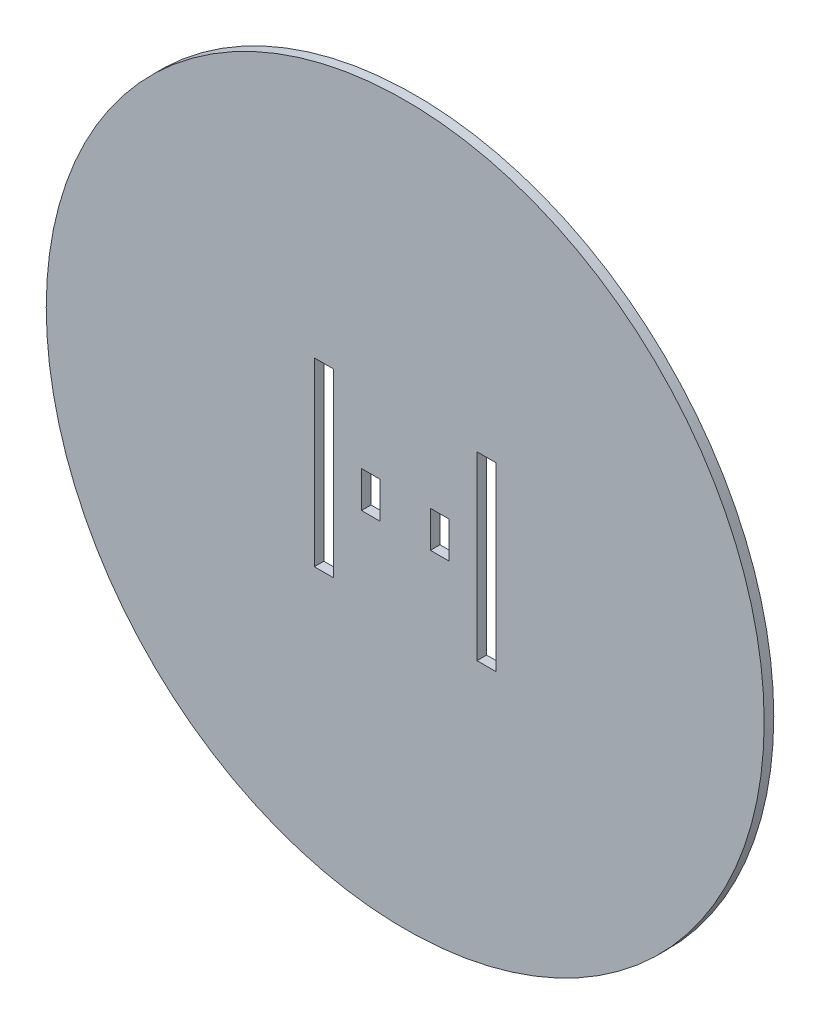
ISO-10303-21;
HEADER;
FILE_DESCRIPTION(('STEP AP214'),'2;1');
FILE_NAME('part.step','',(''),(''),'','','');
FILE_SCHEMA(('AUTOMOTIVE_DESIGN { 1 0 10303 214 1 1 1 1 }'));
ENDSEC;
DATA;
#1=APPLICATION_CONTEXT('core data for automotive mechanical design processes');
#2=APPLICATION_PROTOCOL_DEFINITION('international standard','automotive_design',2000,#1);
#3=PRODUCT_CONTEXT('',#1,'mechanical');
#4=PRODUCT('Part','Part','',(#3));
#5=PRODUCT_RELATED_PRODUCT_CATEGORY('part','',(#4));
#6=PRODUCT_DEFINITION_FORMATION('','',#4);
#7=PRODUCT_DEFINITION_CONTEXT('part definition',#1,'design');
#8=PRODUCT_DEFINITION('design','',#6,#7);
#9=PRODUCT_DEFINITION_SHAPE('','',#8);
#10=(LENGTH_UNIT() NAMED_UNIT(*) SI_UNIT(.MILLI.,.METRE.));
#11=(NAMED_UNIT(*) PLANE_ANGLE_UNIT() SI_UNIT($,.RADIAN.));
#12=(NAMED_UNIT(*) SI_UNIT($,.STERADIAN.) SOLID_ANGLE_UNIT());
#13=UNCERTAINTY_MEASURE_WITH_UNIT(LENGTH_MEASURE(1.E-05),#10,'distance_accuracy_value','');
#14=(GEOMETRIC_REPRESENTATION_CONTEXT(3) GLOBAL_UNCERTAINTY_ASSIGNED_CONTEXT((#13)) GLOBAL_UNIT_ASSIGNED_CONTEXT((#10,
#11,#12)) REPRESENTATION_CONTEXT('',''));
#15=CARTESIAN_POINT('',(0.,0.,0.));
#16=DIRECTION('',(0.,0.,1.));
#17=DIRECTION('',(1.,0.,0.));
#18=AXIS2_PLACEMENT_3D('',#15,#16,#17);
#19=CARTESIAN_POINT('',(0.,0.,3.));
#20=DIRECTION('',(0.,0.,1.));
#21=DIRECTION('',(1.,0.,0.));
#22=AXIS2_PLACEMENT_3D('',#19,#20,#21);
#23=PLANE('',#22);
#24=CARTESIAN_POINT('',(0.,0.,3.));
#25=DIRECTION('',(0.,0.,1.));
#26=DIRECTION('',(1.,0.,0.));
#27=AXIS2_PLACEMENT_3D('',#24,#25,#26);
#28=CIRCLE('',#27,112.5);
#29=CARTESIAN_POINT('',(112.5,0.,3.));
#30=VERTEX_POINT('',#29);
#31=EDGE_CURVE('E11',#30,#30,#28,.T.);
#32=ORIENTED_EDGE('',*,*,#31,.T.);
#33=EDGE_LOOP('',(#32));
#34=FACE_BOUND('',#33,.T.);
#35=DIRECTION('',(1.,0.,0.));
#36=VECTOR('',#35,1.);
#37=CARTESIAN_POINT('',(-13.6999999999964,-5.7,3.));
#38=LINE('',#37,#36);
#39=CARTESIAN_POINT('',(-13.6999999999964,-5.7,3.));
#40=VERTEX_POINT('',#39);
#41=CARTESIAN_POINT('',(-7.89999999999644,-5.7,3.));
#42=VERTEX_POINT('',#41);
#43=EDGE_CURVE('E245',#40,#42,#38,.T.);
#44=ORIENTED_EDGE('',*,*,#43,.F.);
#45=DIRECTION('',(0.,-1.,0.));
#46=VECTOR('',#45,1.);
#47=CARTESIAN_POINT('',(-13.6999999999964,-5.7,3.));
#48=LINE('',#47,#46);
#49=CARTESIAN_POINT('',(-13.6999999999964,5.7,3.));
#50=VERTEX_POINT('',#49);
#51=EDGE_CURVE('E243',#50,#40,#48,.T.);
#52=ORIENTED_EDGE('',*,*,#51,.F.);
#53=DIRECTION('',(-1.,0.,0.));
#54=VECTOR('',#53,1.);
#55=CARTESIAN_POINT('',(-13.6999999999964,5.7,3.));
#56=LINE('',#55,#54);
#57=CARTESIAN_POINT('',(-7.89999999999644,5.7,3.));
#58=VERTEX_POINT('',#57);
#59=EDGE_CURVE('E251',#58,#50,#56,.T.);
#60=ORIENTED_EDGE('',*,*,#59,.F.);
#61=DIRECTION('',(0.,1.,0.));
#62=VECTOR('',#61,1.);
#63=CARTESIAN_POINT('',(-7.89999999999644,-5.7,3.));
#64=LINE('',#63,#62);
#65=EDGE_CURVE('E248',#42,#58,#64,.T.);
#66=ORIENTED_EDGE('',*,*,#65,.F.);
#67=EDGE_LOOP('',(#44,#52,#60,#66));
#68=FACE_BOUND('',#67,.T.);
#69=DIRECTION('',(-1.,0.,0.));
#70=VECTOR('',#69,1.);
#71=CARTESIAN_POINT('',(13.7000000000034,5.7,3.));
#72=LINE('',#71,#70);
#73=CARTESIAN_POINT('',(13.7000000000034,5.7,3.));
#74=VERTEX_POINT('',#73);
#75=CARTESIAN_POINT('',(7.90000000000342,5.7,3.));
#76=VERTEX_POINT('',#75);
#77=EDGE_CURVE('E214',#74,#76,#72,.T.);
#78=ORIENTED_EDGE('',*,*,#77,.F.);
#79=DIRECTION('',(0.,1.,0.));
#80=VECTOR('',#79,1.);
#81=CARTESIAN_POINT('',(13.7000000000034,-5.7,3.));
#82=LINE('',#81,#80);
#83=CARTESIAN_POINT('',(13.7000000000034,-5.7,3.));
#84=VERTEX_POINT('',#83);
#85=EDGE_CURVE('E212',#84,#74,#82,.T.);
#86=ORIENTED_EDGE('',*,*,#85,.F.);
#87=DIRECTION('',(1.,0.,0.));
#88=VECTOR('',#87,1.);
#89=CARTESIAN_POINT('',(13.7000000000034,-5.7,3.));
#90=LINE('',#89,#88);
#91=CARTESIAN_POINT('',(7.90000000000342,-5.7,3.));
#92=VERTEX_POINT('',#91);
#93=EDGE_CURVE('E220',#92,#84,#90,.T.);
#94=ORIENTED_EDGE('',*,*,#93,.F.);
#95=DIRECTION('',(0.,-1.,0.));
#96=VECTOR('',#95,1.);
#97=CARTESIAN_POINT('',(7.90000000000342,-5.7,3.));
#98=LINE('',#97,#96);
#99=EDGE_CURVE('E217',#76,#92,#98,.T.);
#100=ORIENTED_EDGE('',*,*,#99,.F.);
#101=EDGE_LOOP('',(#78,#86,#94,#100));
#102=FACE_BOUND('',#101,.T.);
#103=DIRECTION('',(-1.,0.,0.));
#104=VECTOR('',#103,1.);
#105=CARTESIAN_POINT('',(-28.4799999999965,28.3399999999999,3.));
#106=LINE('',#105,#104);
#107=CARTESIAN_POINT('',(-22.4999999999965,28.3399999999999,3.));
#108=VERTEX_POINT('',#107);
#109=CARTESIAN_POINT('',(-28.4799999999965,28.3399999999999,3.));
#110=VERTEX_POINT('',#109);
#111=EDGE_CURVE('E183',#108,#110,#106,.T.);
#112=ORIENTED_EDGE('',*,*,#111,.F.);
#113=DIRECTION('',(0.,1.,0.));
#114=VECTOR('',#113,1.);
#115=CARTESIAN_POINT('',(-22.4999999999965,28.3399999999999,3.));
#116=LINE('',#115,#114);
#117=CARTESIAN_POINT('',(-22.4999999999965,-28.3400000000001,3.));
#118=VERTEX_POINT('',#117);
#119=EDGE_CURVE('E181',#118,#108,#116,.T.);
#120=ORIENTED_EDGE('',*,*,#119,.F.);
#121=DIRECTION('',(1.,0.,0.));
#122=VECTOR('',#121,1.);
#123=CARTESIAN_POINT('',(-28.4799999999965,-28.3400000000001,3.));
#124=LINE('',#123,#122);
#125=CARTESIAN_POINT('',(-28.4799999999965,-28.3400000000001,3.));
#126=VERTEX_POINT('',#125);
#127=EDGE_CURVE('E189',#126,#118,#124,.T.);
#128=ORIENTED_EDGE('',*,*,#127,.F.);
#129=DIRECTION('',(0.,-1.,0.));
#130=VECTOR('',#129,1.);
#131=CARTESIAN_POINT('',(-28.4799999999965,28.3399999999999,3.));
#132=LINE('',#131,#130);
#133=EDGE_CURVE('E186',#110,#126,#132,.T.);
#134=ORIENTED_EDGE('',*,*,#133,.F.);
#135=EDGE_LOOP('',(#112,#120,#128,#134));
#136=FACE_BOUND('',#135,.T.);
#137=DIRECTION('',(-1.,0.,0.));
#138=VECTOR('',#137,1.);
#139=CARTESIAN_POINT('',(28.4800000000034,28.3399999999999,3.));
#140=LINE('',#139,#138);
#141=CARTESIAN_POINT('',(28.4800000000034,28.3399999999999,3.));
#142=VERTEX_POINT('',#141);
#143=CARTESIAN_POINT('',(22.5000000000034,28.3399999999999,3.));
#144=VERTEX_POINT('',#143);
#145=EDGE_CURVE('E153',#142,#144,#140,.T.);
#146=ORIENTED_EDGE('',*,*,#145,.F.);
#147=DIRECTION('',(0.,1.,0.));
#148=VECTOR('',#147,1.);
#149=CARTESIAN_POINT('',(28.4800000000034,28.3399999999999,3.));
#150=LINE('',#149,#148);
#151=CARTESIAN_POINT('',(28.4800000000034,-28.3400000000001,3.));
#152=VERTEX_POINT('',#151);
#153=EDGE_CURVE('E145',#152,#142,#150,.T.);
#154=ORIENTED_EDGE('',*,*,#153,.F.);
#155=DIRECTION('',(1.,0.,0.));
#156=VECTOR('',#155,1.);
#157=CARTESIAN_POINT('',(28.4800000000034,-28.3400000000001,3.));
#158=LINE('',#157,#156);
#159=CARTESIAN_POINT('',(22.5000000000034,-28.3400000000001,3.));
#160=VERTEX_POINT('',#159);
#161=EDGE_CURVE('E167',#160,#152,#158,.T.);
#162=ORIENTED_EDGE('',*,*,#161,.F.);
#163=DIRECTION('',(0.,-1.,0.));
#164=VECTOR('',#163,1.);
#165=CARTESIAN_POINT('',(22.5000000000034,28.3399999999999,3.));
#166=LINE('',#165,#164);
#167=EDGE_CURVE('E165',#144,#160,#166,.T.);
#168=ORIENTED_EDGE('',*,*,#167,.F.);
#169=EDGE_LOOP('',(#146,#154,#162,#168));
#170=FACE_BOUND('',#169,.T.);
#171=ADVANCED_FACE('F32',(#34,#68,#102,#136,#170),#23,.T.);
#172=CARTESIAN_POINT('',(0.,0.,0.));
#173=DIRECTION('',(0.,0.,1.));
#174=DIRECTION('',(1.,0.,0.));
#175=AXIS2_PLACEMENT_3D('',#172,#173,#174);
#176=PLANE('',#175);
#177=DIRECTION('',(0.,1.,0.));
#178=VECTOR('',#177,1.);
#179=CARTESIAN_POINT('',(-22.4999999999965,28.3399999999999,0.));
#180=LINE('',#179,#178);
#181=CARTESIAN_POINT('',(-22.4999999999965,-28.3400000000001,0.));
#182=VERTEX_POINT('',#181);
#183=CARTESIAN_POINT('',(-22.4999999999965,28.3399999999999,0.));
#184=VERTEX_POINT('',#183);
#185=EDGE_CURVE('E161',#182,#184,#180,.T.);
#186=ORIENTED_EDGE('',*,*,#185,.T.);
#187=DIRECTION('',(-1.,0.,0.));
#188=VECTOR('',#187,1.);
#189=CARTESIAN_POINT('',(-28.4799999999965,28.3399999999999,0.));
#190=LINE('',#189,#188);
#191=CARTESIAN_POINT('',(-28.4799999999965,28.3399999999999,0.));
#192=VERTEX_POINT('',#191);
#193=EDGE_CURVE('E194',#184,#192,#190,.T.);
#194=ORIENTED_EDGE('',*,*,#193,.T.);
#195=DIRECTION('',(0.,-1.,0.));
#196=VECTOR('',#195,1.);
#197=CARTESIAN_POINT('',(-28.4799999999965,28.3399999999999,0.));
#198=LINE('',#197,#196);
#199=CARTESIAN_POINT('',(-28.4799999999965,-28.3400000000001,0.));
#200=VERTEX_POINT('',#199);
#201=EDGE_CURVE('E197',#192,#200,#198,.T.);
#202=ORIENTED_EDGE('',*,*,#201,.T.);
#203=DIRECTION('',(1.,0.,0.));
#204=VECTOR('',#203,1.);
#205=CARTESIAN_POINT('',(-28.4799999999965,-28.3400000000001,0.));
#206=LINE('',#205,#204);
#207=EDGE_CURVE('E184',#200,#182,#206,.T.);
#208=ORIENTED_EDGE('',*,*,#207,.T.);
#209=EDGE_LOOP('',(#186,#194,#202,#208));
#210=FACE_BOUND('',#209,.T.);
#211=DIRECTION('',(0.,-1.,0.));
#212=VECTOR('',#211,1.);
#213=CARTESIAN_POINT('',(-13.6999999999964,-5.7,0.));
#214=LINE('',#213,#212);
#215=CARTESIAN_POINT('',(-13.6999999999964,5.7,0.));
#216=VERTEX_POINT('',#215);
#217=CARTESIAN_POINT('',(-13.6999999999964,-5.7,0.));
#218=VERTEX_POINT('',#217);
#219=EDGE_CURVE('E242',#216,#218,#214,.T.);
#220=ORIENTED_EDGE('',*,*,#219,.T.);
#221=DIRECTION('',(1.,0.,0.));
#222=VECTOR('',#221,1.);
#223=CARTESIAN_POINT('',(-13.6999999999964,-5.7,0.));
#224=LINE('',#223,#222);
#225=CARTESIAN_POINT('',(-7.89999999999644,-5.7,0.));
#226=VERTEX_POINT('',#225);
#227=EDGE_CURVE('E256',#218,#226,#224,.T.);
#228=ORIENTED_EDGE('',*,*,#227,.T.);
#229=DIRECTION('',(0.,1.,0.));
#230=VECTOR('',#229,1.);
#231=CARTESIAN_POINT('',(-7.89999999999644,-5.7,0.));
#232=LINE('',#231,#230);
#233=CARTESIAN_POINT('',(-7.89999999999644,5.7,0.));
#234=VERTEX_POINT('',#233);
#235=EDGE_CURVE('E259',#226,#234,#232,.T.);
#236=ORIENTED_EDGE('',*,*,#235,.T.);
#237=DIRECTION('',(-1.,0.,0.));
#238=VECTOR('',#237,1.);
#239=CARTESIAN_POINT('',(-13.6999999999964,5.7,0.));
#240=LINE('',#239,#238);
#241=EDGE_CURVE('E246',#234,#216,#240,.T.);
#242=ORIENTED_EDGE('',*,*,#241,.T.);
#243=EDGE_LOOP('',(#220,#228,#236,#242));
#244=FACE_BOUND('',#243,.T.);
#245=CARTESIAN_POINT('',(0.,0.,0.));
#246=DIRECTION('',(0.,0.,1.));
#247=DIRECTION('',(1.,0.,0.));
#248=AXIS2_PLACEMENT_3D('',#245,#246,#247);
#249=CIRCLE('',#248,112.5);
#250=CARTESIAN_POINT('',(112.5,0.,0.));
#251=VERTEX_POINT('',#250);
#252=EDGE_CURVE('E36',#251,#251,#249,.T.);
#253=ORIENTED_EDGE('',*,*,#252,.F.);
#254=EDGE_LOOP('',(#253));
#255=FACE_BOUND('',#254,.T.);
#256=DIRECTION('',(0.,1.,0.));
#257=VECTOR('',#256,1.);
#258=CARTESIAN_POINT('',(13.7000000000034,-5.7,0.));
#259=LINE('',#258,#257);
#260=CARTESIAN_POINT('',(13.7000000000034,-5.7,0.));
#261=VERTEX_POINT('',#260);
#262=CARTESIAN_POINT('',(13.7000000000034,5.7,0.));
#263=VERTEX_POINT('',#262);
#264=EDGE_CURVE('E211',#261,#263,#259,.T.);
#265=ORIENTED_EDGE('',*,*,#264,.T.);
#266=DIRECTION('',(-1.,0.,0.));
#267=VECTOR('',#266,1.);
#268=CARTESIAN_POINT('',(13.7000000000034,5.7,0.));
#269=LINE('',#268,#267);
#270=CARTESIAN_POINT('',(7.90000000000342,5.7,0.));
#271=VERTEX_POINT('',#270);
#272=EDGE_CURVE('E225',#263,#271,#269,.T.);
#273=ORIENTED_EDGE('',*,*,#272,.T.);
#274=DIRECTION('',(0.,-1.,0.));
#275=VECTOR('',#274,1.);
#276=CARTESIAN_POINT('',(7.90000000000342,-5.7,0.));
#277=LINE('',#276,#275);
#278=CARTESIAN_POINT('',(7.90000000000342,-5.7,0.));
#279=VERTEX_POINT('',#278);
#280=EDGE_CURVE('E228',#271,#279,#277,.T.);
#281=ORIENTED_EDGE('',*,*,#280,.T.);
#282=DIRECTION('',(1.,0.,0.));
#283=VECTOR('',#282,1.);
#284=CARTESIAN_POINT('',(13.7000000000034,-5.7,0.));
#285=LINE('',#284,#283);
#286=EDGE_CURVE('E215',#279,#261,#285,.T.);
#287=ORIENTED_EDGE('',*,*,#286,.T.);
#288=EDGE_LOOP('',(#265,#273,#281,#287));
#289=FACE_BOUND('',#288,.T.);
#290=DIRECTION('',(0.,1.,0.));
#291=VECTOR('',#290,1.);
#292=CARTESIAN_POINT('',(28.4800000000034,28.3399999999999,0.));
#293=LINE('',#292,#291);
#294=CARTESIAN_POINT('',(28.4800000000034,-28.3400000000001,0.));
#295=VERTEX_POINT('',#294);
#296=CARTESIAN_POINT('',(28.4800000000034,28.3399999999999,0.));
#297=VERTEX_POINT('',#296);
#298=EDGE_CURVE('E55',#295,#297,#293,.T.);
#299=ORIENTED_EDGE('',*,*,#298,.T.);
#300=DIRECTION('',(-1.,0.,0.));
#301=VECTOR('',#300,1.);
#302=CARTESIAN_POINT('',(28.4800000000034,28.3399999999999,0.));
#303=LINE('',#302,#301);
#304=CARTESIAN_POINT('',(22.5000000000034,28.3399999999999,0.));
#305=VERTEX_POINT('',#304);
#306=EDGE_CURVE('E160',#297,#305,#303,.T.);
#307=ORIENTED_EDGE('',*,*,#306,.T.);
#308=DIRECTION('',(0.,-1.,0.));
#309=VECTOR('',#308,1.);
#310=CARTESIAN_POINT('',(22.5000000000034,28.3399999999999,0.));
#311=LINE('',#310,#309);
#312=CARTESIAN_POINT('',(22.5000000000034,-28.3400000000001,0.));
#313=VERTEX_POINT('',#312);
#314=EDGE_CURVE('E173',#305,#313,#311,.T.);
#315=ORIENTED_EDGE('',*,*,#314,.T.);
#316=DIRECTION('',(1.,0.,0.));
#317=VECTOR('',#316,1.);
#318=CARTESIAN_POINT('',(28.4800000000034,-28.3400000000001,0.));
#319=LINE('',#318,#317);
#320=EDGE_CURVE('E154',#313,#295,#319,.T.);
#321=ORIENTED_EDGE('',*,*,#320,.T.);
#322=EDGE_LOOP('',(#299,#307,#315,#321));
#323=FACE_BOUND('',#322,.T.);
#324=ADVANCED_FACE('F278',(#210,#244,#255,#289,#323),#176,.F.);
#325=CARTESIAN_POINT('',(0.,0.,3.));
#326=DIRECTION('',(0.,0.,-1.));
#327=DIRECTION('',(-1.,0.,0.));
#328=AXIS2_PLACEMENT_3D('',#325,#326,#327);
#329=CYLINDRICAL_SURFACE('',#328,112.5);
#330=ORIENTED_EDGE('',*,*,#31,.F.);
#331=EDGE_LOOP('',(#330));
#332=FACE_BOUND('',#331,.T.);
#333=ORIENTED_EDGE('',*,*,#252,.T.);
#334=EDGE_LOOP('',(#333));
#335=FACE_BOUND('',#334,.T.);
#336=ADVANCED_FACE('F34',(#332,#335),#329,.T.);
#337=CARTESIAN_POINT('',(-13.6999999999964,-5.7,3.));
#338=DIRECTION('',(1.,0.,0.));
#339=DIRECTION('',(0.,0.,-1.));
#340=AXIS2_PLACEMENT_3D('',#337,#338,#339);
#341=PLANE('',#340);
#342=ORIENTED_EDGE('',*,*,#219,.F.);
#343=DIRECTION('',(0.,0.,-1.));
#344=VECTOR('',#343,1.);
#345=CARTESIAN_POINT('',(-13.6999999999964,5.7,3.));
#346=LINE('',#345,#344);
#347=EDGE_CURVE('E253',#50,#216,#346,.T.);
#348=ORIENTED_EDGE('',*,*,#347,.F.);
#349=ORIENTED_EDGE('',*,*,#51,.T.);
#350=DIRECTION('',(0.,0.,-1.));
#351=VECTOR('',#350,1.);
#352=CARTESIAN_POINT('',(-13.6999999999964,-5.7,3.));
#353=LINE('',#352,#351);
#354=EDGE_CURVE('E270',#40,#218,#353,.T.);
#355=ORIENTED_EDGE('',*,*,#354,.T.);
#356=EDGE_LOOP('',(#342,#348,#349,#355));
#357=FACE_BOUND('',#356,.T.);
#358=ADVANCED_FACE('F300',(#357),#341,.T.);
#359=CARTESIAN_POINT('',(-13.6999999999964,-5.7,3.));
#360=DIRECTION('',(0.,1.,0.));
#361=DIRECTION('',(0.,0.,1.));
#362=AXIS2_PLACEMENT_3D('',#359,#360,#361);
#363=PLANE('',#362);
#364=ORIENTED_EDGE('',*,*,#227,.F.);
#365=ORIENTED_EDGE('',*,*,#354,.F.);
#366=ORIENTED_EDGE('',*,*,#43,.T.);
#367=DIRECTION('',(0.,0.,-1.));
#368=VECTOR('',#367,1.);
#369=CARTESIAN_POINT('',(-7.89999999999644,-5.7,3.));
#370=LINE('',#369,#368);
#371=EDGE_CURVE('E268',#42,#226,#370,.T.);
#372=ORIENTED_EDGE('',*,*,#371,.T.);
#373=EDGE_LOOP('',(#364,#365,#366,#372));
#374=FACE_BOUND('',#373,.T.);
#375=ADVANCED_FACE('F303',(#374),#363,.T.);
#376=CARTESIAN_POINT('',(-7.89999999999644,-5.7,3.));
#377=DIRECTION('',(-1.,0.,0.));
#378=DIRECTION('',(0.,0.,1.));
#379=AXIS2_PLACEMENT_3D('',#376,#377,#378);
#380=PLANE('',#379);
#381=ORIENTED_EDGE('',*,*,#235,.F.);
#382=ORIENTED_EDGE('',*,*,#371,.F.);
#383=ORIENTED_EDGE('',*,*,#65,.T.);
#384=DIRECTION('',(0.,0.,-1.));
#385=VECTOR('',#384,1.);
#386=CARTESIAN_POINT('',(-7.89999999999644,5.7,3.));
#387=LINE('',#386,#385);
#388=EDGE_CURVE('E266',#58,#234,#387,.T.);
#389=ORIENTED_EDGE('',*,*,#388,.T.);
#390=EDGE_LOOP('',(#381,#382,#383,#389));
#391=FACE_BOUND('',#390,.T.);
#392=ADVANCED_FACE('F306',(#391),#380,.T.);
#393=CARTESIAN_POINT('',(-13.6999999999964,5.7,3.));
#394=DIRECTION('',(0.,-1.,0.));
#395=DIRECTION('',(0.,0.,-1.));
#396=AXIS2_PLACEMENT_3D('',#393,#394,#395);
#397=PLANE('',#396);
#398=ORIENTED_EDGE('',*,*,#241,.F.);
#399=ORIENTED_EDGE('',*,*,#388,.F.);
#400=ORIENTED_EDGE('',*,*,#59,.T.);
#401=ORIENTED_EDGE('',*,*,#347,.T.);
#402=EDGE_LOOP('',(#398,#399,#400,#401));
#403=FACE_BOUND('',#402,.T.);
#404=ADVANCED_FACE('F310',(#403),#397,.T.);
#405=CARTESIAN_POINT('',(13.7000000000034,-5.7,3.));
#406=DIRECTION('',(-1.,0.,0.));
#407=DIRECTION('',(0.,0.,1.));
#408=AXIS2_PLACEMENT_3D('',#405,#406,#407);
#409=PLANE('',#408);
#410=ORIENTED_EDGE('',*,*,#264,.F.);
#411=DIRECTION('',(0.,0.,-1.));
#412=VECTOR('',#411,1.);
#413=CARTESIAN_POINT('',(13.7000000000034,-5.7,3.));
#414=LINE('',#413,#412);
#415=EDGE_CURVE('E222',#84,#261,#414,.T.);
#416=ORIENTED_EDGE('',*,*,#415,.F.);
#417=ORIENTED_EDGE('',*,*,#85,.T.);
#418=DIRECTION('',(0.,0.,-1.));
#419=VECTOR('',#418,1.);
#420=CARTESIAN_POINT('',(13.7000000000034,5.7,3.));
#421=LINE('',#420,#419);
#422=EDGE_CURVE('E239',#74,#263,#421,.T.);
#423=ORIENTED_EDGE('',*,*,#422,.T.);
#424=EDGE_LOOP('',(#410,#416,#417,#423));
#425=FACE_BOUND('',#424,.T.);
#426=ADVANCED_FACE('F314',(#425),#409,.T.);
#427=CARTESIAN_POINT('',(13.7000000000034,5.7,3.));
#428=DIRECTION('',(0.,-1.,0.));
#429=DIRECTION('',(0.,0.,-1.));
#430=AXIS2_PLACEMENT_3D('',#427,#428,#429);
#431=PLANE('',#430);
#432=ORIENTED_EDGE('',*,*,#272,.F.);
#433=ORIENTED_EDGE('',*,*,#422,.F.);
#434=ORIENTED_EDGE('',*,*,#77,.T.);
#435=DIRECTION('',(0.,0.,-1.));
#436=VECTOR('',#435,1.);
#437=CARTESIAN_POINT('',(7.90000000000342,5.7,3.));
#438=LINE('',#437,#436);
#439=EDGE_CURVE('E237',#76,#271,#438,.T.);
#440=ORIENTED_EDGE('',*,*,#439,.T.);
#441=EDGE_LOOP('',(#432,#433,#434,#440));
#442=FACE_BOUND('',#441,.T.);
#443=ADVANCED_FACE('F318',(#442),#431,.T.);
#444=CARTESIAN_POINT('',(7.90000000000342,-5.7,3.));
#445=DIRECTION('',(1.,0.,0.));
#446=DIRECTION('',(0.,0.,-1.));
#447=AXIS2_PLACEMENT_3D('',#444,#445,#446);
#448=PLANE('',#447);
#449=ORIENTED_EDGE('',*,*,#280,.F.);
#450=ORIENTED_EDGE('',*,*,#439,.F.);
#451=ORIENTED_EDGE('',*,*,#99,.T.);
#452=DIRECTION('',(0.,0.,-1.));
#453=VECTOR('',#452,1.);
#454=CARTESIAN_POINT('',(7.90000000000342,-5.7,3.));
#455=LINE('',#454,#453);
#456=EDGE_CURVE('E235',#92,#279,#455,.T.);
#457=ORIENTED_EDGE('',*,*,#456,.T.);
#458=EDGE_LOOP('',(#449,#450,#451,#457));
#459=FACE_BOUND('',#458,.T.);
#460=ADVANCED_FACE('F322',(#459),#448,.T.);
#461=CARTESIAN_POINT('',(13.7000000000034,-5.7,3.));
#462=DIRECTION('',(0.,1.,0.));
#463=DIRECTION('',(0.,0.,1.));
#464=AXIS2_PLACEMENT_3D('',#461,#462,#463);
#465=PLANE('',#464);
#466=ORIENTED_EDGE('',*,*,#286,.F.);
#467=ORIENTED_EDGE('',*,*,#456,.F.);
#468=ORIENTED_EDGE('',*,*,#93,.T.);
#469=ORIENTED_EDGE('',*,*,#415,.T.);
#470=EDGE_LOOP('',(#466,#467,#468,#469));
#471=FACE_BOUND('',#470,.T.);
#472=ADVANCED_FACE('F326',(#471),#465,.T.);
#473=CARTESIAN_POINT('',(-22.4999999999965,28.3399999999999,3.));
#474=DIRECTION('',(-1.,0.,0.));
#475=DIRECTION('',(0.,0.,1.));
#476=AXIS2_PLACEMENT_3D('',#473,#474,#475);
#477=PLANE('',#476);
#478=ORIENTED_EDGE('',*,*,#185,.F.);
#479=DIRECTION('',(0.,0.,-1.));
#480=VECTOR('',#479,1.);
#481=CARTESIAN_POINT('',(-22.4999999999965,-28.3400000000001,3.));
#482=LINE('',#481,#480);
#483=EDGE_CURVE('E191',#118,#182,#482,.T.);
#484=ORIENTED_EDGE('',*,*,#483,.F.);
#485=ORIENTED_EDGE('',*,*,#119,.T.);
#486=DIRECTION('',(0.,0.,-1.));
#487=VECTOR('',#486,1.);
#488=CARTESIAN_POINT('',(-22.4999999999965,28.3399999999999,3.));
#489=LINE('',#488,#487);
#490=EDGE_CURVE('E208',#108,#184,#489,.T.);
#491=ORIENTED_EDGE('',*,*,#490,.T.);
#492=EDGE_LOOP('',(#478,#484,#485,#491));
#493=FACE_BOUND('',#492,.T.);
#494=ADVANCED_FACE('F330',(#493),#477,.T.);
#495=CARTESIAN_POINT('',(-28.4799999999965,28.3399999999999,3.));
#496=DIRECTION('',(0.,-1.,0.));
#497=DIRECTION('',(0.,0.,-1.));
#498=AXIS2_PLACEMENT_3D('',#495,#496,#497);
#499=PLANE('',#498);
#500=ORIENTED_EDGE('',*,*,#193,.F.);
#501=ORIENTED_EDGE('',*,*,#490,.F.);
#502=ORIENTED_EDGE('',*,*,#111,.T.);
#503=DIRECTION('',(0.,0.,-1.));
#504=VECTOR('',#503,1.);
#505=CARTESIAN_POINT('',(-28.4799999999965,28.3399999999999,3.));
#506=LINE('',#505,#504);
#507=EDGE_CURVE('E206',#110,#192,#506,.T.);
#508=ORIENTED_EDGE('',*,*,#507,.T.);
#509=EDGE_LOOP('',(#500,#501,#502,#508));
#510=FACE_BOUND('',#509,.T.);
#511=ADVANCED_FACE('F334',(#510),#499,.T.);
#512=CARTESIAN_POINT('',(-28.4799999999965,28.3399999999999,3.));
#513=DIRECTION('',(1.,0.,0.));
#514=DIRECTION('',(0.,1.,0.));
#515=AXIS2_PLACEMENT_3D('',#512,#513,#514);
#516=PLANE('',#515);
#517=ORIENTED_EDGE('',*,*,#201,.F.);
#518=ORIENTED_EDGE('',*,*,#507,.F.);
#519=ORIENTED_EDGE('',*,*,#133,.T.);
#520=DIRECTION('',(0.,0.,-1.));
#521=VECTOR('',#520,1.);
#522=CARTESIAN_POINT('',(-28.4799999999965,-28.3400000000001,3.));
#523=LINE('',#522,#521);
#524=EDGE_CURVE('E204',#126,#200,#523,.T.);
#525=ORIENTED_EDGE('',*,*,#524,.T.);
#526=EDGE_LOOP('',(#517,#518,#519,#525));
#527=FACE_BOUND('',#526,.T.);
#528=ADVANCED_FACE('F338',(#527),#516,.T.);
#529=CARTESIAN_POINT('',(-28.4799999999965,-28.3400000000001,3.));
#530=DIRECTION('',(0.,1.,0.));
#531=DIRECTION('',(0.,0.,1.));
#532=AXIS2_PLACEMENT_3D('',#529,#530,#531);
#533=PLANE('',#532);
#534=ORIENTED_EDGE('',*,*,#207,.F.);
#535=ORIENTED_EDGE('',*,*,#524,.F.);
#536=ORIENTED_EDGE('',*,*,#127,.T.);
#537=ORIENTED_EDGE('',*,*,#483,.T.);
#538=EDGE_LOOP('',(#534,#535,#536,#537));
#539=FACE_BOUND('',#538,.T.);
#540=ADVANCED_FACE('F342',(#539),#533,.T.);
#541=CARTESIAN_POINT('',(28.4800000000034,28.3399999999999,3.));
#542=DIRECTION('',(-1.,0.,0.));
#543=DIRECTION('',(0.,-1.,0.));
#544=AXIS2_PLACEMENT_3D('',#541,#542,#543);
#545=PLANE('',#544);
#546=ORIENTED_EDGE('',*,*,#298,.F.);
#547=DIRECTION('',(0.,0.,-1.));
#548=VECTOR('',#547,1.);
#549=CARTESIAN_POINT('',(28.4800000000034,-28.3400000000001,3.));
#550=LINE('',#549,#548);
#551=EDGE_CURVE('E149',#152,#295,#550,.T.);
#552=ORIENTED_EDGE('',*,*,#551,.F.);
#553=ORIENTED_EDGE('',*,*,#153,.T.);
#554=DIRECTION('',(0.,0.,-1.));
#555=VECTOR('',#554,1.);
#556=CARTESIAN_POINT('',(28.4800000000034,28.3399999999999,3.));
#557=LINE('',#556,#555);
#558=EDGE_CURVE('E148',#142,#297,#557,.T.);
#559=ORIENTED_EDGE('',*,*,#558,.T.);
#560=EDGE_LOOP('',(#546,#552,#553,#559));
#561=FACE_BOUND('',#560,.T.);
#562=ADVANCED_FACE('F147',(#561),#545,.T.);
#563=CARTESIAN_POINT('',(28.4800000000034,28.3399999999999,3.));
#564=DIRECTION('',(0.,-1.,0.));
#565=DIRECTION('',(0.,0.,-1.));
#566=AXIS2_PLACEMENT_3D('',#563,#564,#565);
#567=PLANE('',#566);
#568=ORIENTED_EDGE('',*,*,#306,.F.);
#569=ORIENTED_EDGE('',*,*,#558,.F.);
#570=ORIENTED_EDGE('',*,*,#145,.T.);
#571=DIRECTION('',(0.,0.,-1.));
#572=VECTOR('',#571,1.);
#573=CARTESIAN_POINT('',(22.5000000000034,28.3399999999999,3.));
#574=LINE('',#573,#572);
#575=EDGE_CURVE('E162',#144,#305,#574,.T.);
#576=ORIENTED_EDGE('',*,*,#575,.T.);
#577=EDGE_LOOP('',(#568,#569,#570,#576));
#578=FACE_BOUND('',#577,.T.);
#579=ADVANCED_FACE('F157',(#578),#567,.T.);
#580=CARTESIAN_POINT('',(22.5000000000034,28.3399999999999,3.));
#581=DIRECTION('',(1.,0.,0.));
#582=DIRECTION('',(0.,0.,-1.));
#583=AXIS2_PLACEMENT_3D('',#580,#581,#582);
#584=PLANE('',#583);
#585=ORIENTED_EDGE('',*,*,#314,.F.);
#586=ORIENTED_EDGE('',*,*,#575,.F.);
#587=ORIENTED_EDGE('',*,*,#167,.T.);
#588=DIRECTION('',(0.,0.,-1.));
#589=VECTOR('',#588,1.);
#590=CARTESIAN_POINT('',(22.5000000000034,-28.3400000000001,3.));
#591=LINE('',#590,#589);
#592=EDGE_CURVE('E47',#160,#313,#591,.T.);
#593=ORIENTED_EDGE('',*,*,#592,.T.);
#594=EDGE_LOOP('',(#585,#586,#587,#593));
#595=FACE_BOUND('',#594,.T.);
#596=ADVANCED_FACE('F286',(#595),#584,.T.);
#597=CARTESIAN_POINT('',(28.4800000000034,-28.3400000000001,3.));
#598=DIRECTION('',(0.,1.,0.));
#599=DIRECTION('',(0.,0.,1.));
#600=AXIS2_PLACEMENT_3D('',#597,#598,#599);
#601=PLANE('',#600);
#602=ORIENTED_EDGE('',*,*,#320,.F.);
#603=ORIENTED_EDGE('',*,*,#592,.F.);
#604=ORIENTED_EDGE('',*,*,#161,.T.);
#605=ORIENTED_EDGE('',*,*,#551,.T.);
#606=EDGE_LOOP('',(#602,#603,#604,#605));
#607=FACE_BOUND('',#606,.T.);
#608=ADVANCED_FACE('F284',(#607),#601,.T.);
#609=CLOSED_SHELL('',(#171,#324,#336,#358,#375,#392,#404,#426,#443,#460,#472,#494,#511,#528,
#540,#562,#579,#596,#608));
#610=MANIFOLD_SOLID_BREP('B2',#609);
#611=ADVANCED_BREP_SHAPE_REPRESENTATION('',(#18,#610),#14);
#612=SHAPE_DEFINITION_REPRESENTATION(#9,#611);
ENDSEC;
END-ISO-10303-21;
